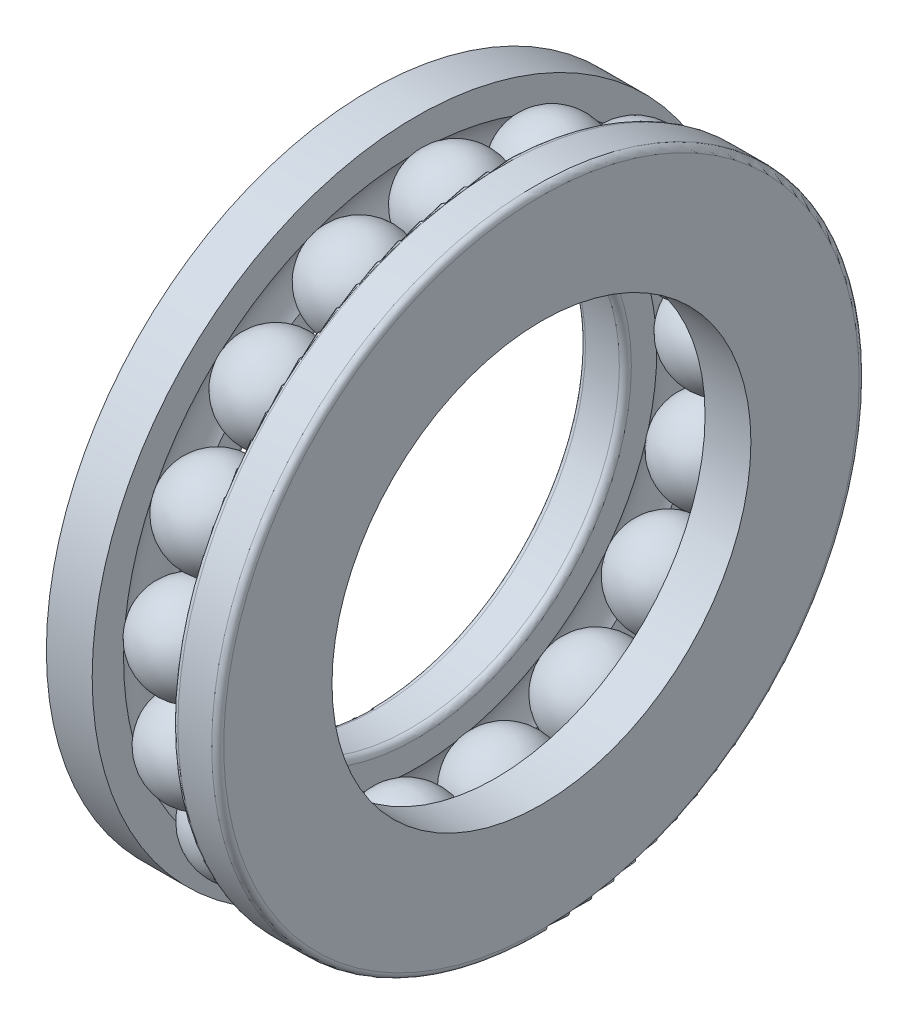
from build123d import *

# Parameters (mm, degrees)
FILLET_2_R          = 1
BALLSDETAILED_COUNT = 17
BALLSDETAILED_ANGLE = 338.823529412


with BuildPart() as part:
    # InnRacSke → Race (revolve)
    with BuildSketch(Plane.XY, mode=Mode.PRIVATE) as race_sk:
        with BuildLine():
            Line((-6.6468625, 40.157346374), (-6.6468625, 34.925))
            Line((-6.6468625, 34.925), (-14.2875, 34.925))
            Line((-14.2875, 34.925), (-14.2875, 53.975))
            Line((-14.2875, 53.975), (-6.6468625, 53.975))
            Line((-6.6468625, 53.975), (-6.6468625, 48.742653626))
            ThreePointArc((-6.6468625, 48.742653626), (-7.9125, 44.45), (-6.6468625, 40.157346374))
        make_face()
    race = revolve(race_sk.sketch.rotate(Axis((-34.925, 0, 0), (1, 0, 0)), 270), axis=Axis((-34.925, 0, 0), (1, 0, 0)))

    # BalDetSke → BallDetailed (revolve)
    with BuildSketch(Plane.XY):
        with BuildLine():
            Line((-7.9375, 44.45), (7.9375, 44.45))
            ThreePointArc((7.9375, 44.45), (0, 36.5125), (-7.9375, 44.45))
        make_face()
    balldetailed = revolve(axis=Axis((-14.57325, 44.45, 0), (1, 0, 0)))

    # Mirror1: Race across plane
    add(race.mirror(Plane(origin=(0, 0, 0), x_dir=(0, 0, 1), z_dir=(1, 0, 0))))

    # Fillet 2
    fillet_2_edges = [part.edges().sort_by_distance(p)[0] for p in [
        (6.6468625, 0, 53.975),
        (14.2875, 0, 53.975),
        (-6.6468625, 0, 34.925),
        (-14.2875, 0, 34.925),
    ]]
    fillet(fillet_2_edges, radius=FILLET_2_R)

    # BallsDetailed: BallDetailed ×17 about axis
    ballsdetailed_axis = Axis((-50, 0, 0), (1, 0, 0))
    for i in range(1, BALLSDETAILED_COUNT):
        add(balldetailed.rotate(ballsdetailed_axis, i * BALLSDETAILED_ANGLE / (BALLSDETAILED_COUNT - 1)))


solid = part.part
